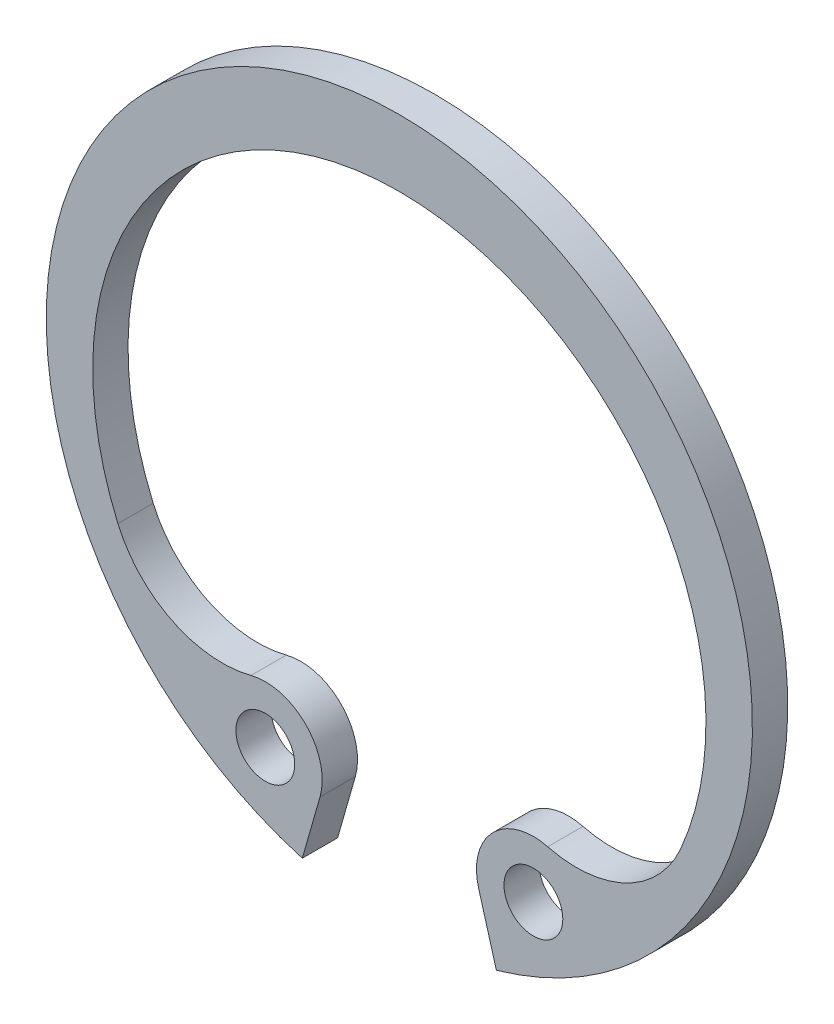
from build123d import *

# Parameters (mm, degrees)
BODYSKE_R  = 0.75
BODY_DEPTH = 0.9


with BuildPart() as part:
    # BodySke → Body (new body)
    with BuildSketch(Plane.XY):
        with BuildLine():
            Line((2.473185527, -8.65351682), (2.022103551, -7.075210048))
            ThreePointArc((2.022103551, -7.075210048), (2.378855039, -5.663713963), (3.781466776, -5.273492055))
            ThreePointArc((3.781466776, -5.273492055), (5.783693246, -5.073191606), (7.173579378, -3.618115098))
            ThreePointArc((7.173579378, -3.618115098), (0, 7.3), (-7.173579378, -3.618115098))
            ThreePointArc((-7.173579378, -3.618115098), (-5.783693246, -5.073191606), (-3.781466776, -5.273492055))
            ThreePointArc((-3.781466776, -5.273492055), (-2.378855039, -5.663713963), (-2.022103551, -7.075210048))
            Line((-2.022103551, -7.075210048), (-2.473185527, -8.65351682))
            ThreePointArc((-2.473185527, -8.65351682), (0, 9), (2.473185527, -8.65351682))
        make_face()
        with Locations((3.416281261, -6.67675238)):
            Circle(BODYSKE_R, mode=Mode.SUBTRACT)
        with Locations((-3.416281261, -6.67675238)):
            Circle(BODYSKE_R, mode=Mode.SUBTRACT)
    extrude(amount=-BODY_DEPTH)


solid = part.part
